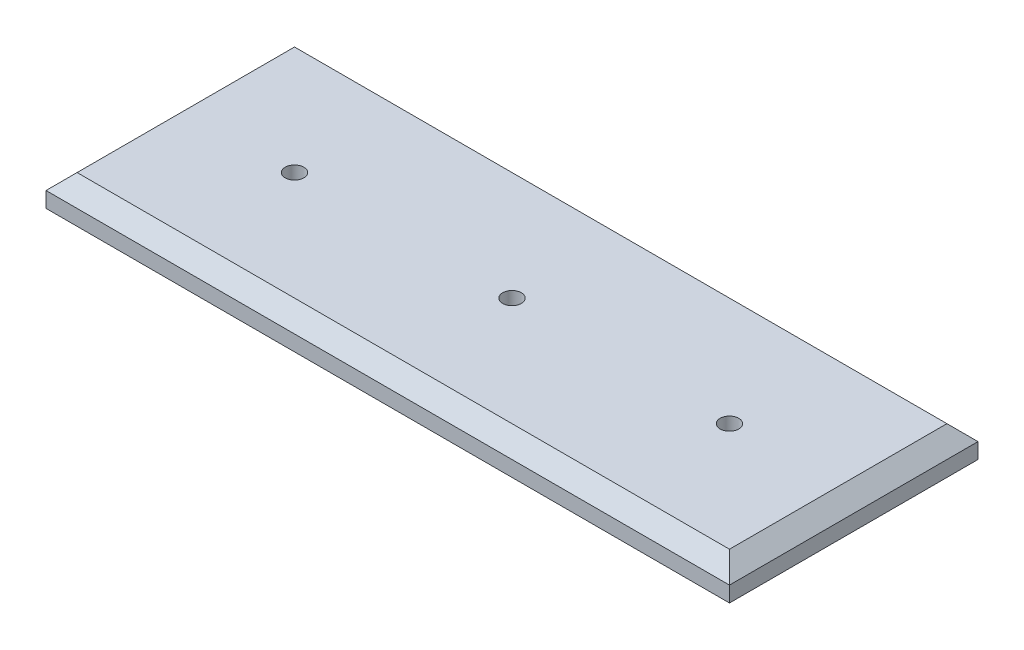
from build123d import *

# Parameters (mm, degrees)
SKETCH1_W      = 220
SKETCH1_H      = 80
EXTRUDE1_DEPTH = 10
SKETCH2_W      = 210
SKETCH2_H      = 70
EXTRUDE2_DEPTH = 5
SKETCH3_R      = 3
EXTRUDE3_DEPTH = 5
CHAMFER1_SIZE  = 5


with BuildPart() as part:
    # Sketch1 → Extrude1 (new body)
    with BuildSketch(Plane(origin=(0, 0, 0), x_dir=(1, 0, 0), z_dir=(0, 1, 0))):
        with Locations((110, 40)):
            Rectangle(SKETCH1_W, SKETCH1_H)
    extrude(amount=EXTRUDE1_DEPTH)

    # Sketch2 → Extrude2 (cut)
    with BuildSketch(Plane.XZ):
        with Locations((110, -40)):
            Rectangle(SKETCH2_W, SKETCH2_H)
    extrude(amount=-EXTRUDE2_DEPTH, mode=Mode.SUBTRACT)

    # Sketch3 → Extrude3 (cut)
    with BuildSketch(Plane(origin=(0, 10, 0), x_dir=(1, 0, 0), z_dir=(0, 1, 0))):
        with Locations(Location((110, 40, 0), (0, 0, 270))):
            Circle(SKETCH3_R)
        with Locations(Location((40, 40, 0), (0, 0, 270))):
            Circle(SKETCH3_R)
        with Locations(Location((180, 40, 0), (0, 0, 270))):
            Circle(SKETCH3_R)
    extrude(amount=-EXTRUDE3_DEPTH, mode=Mode.SUBTRACT)

    # Chamfer1
    chamfer1_edges = [part.edges().sort_by_distance(p)[0] for p in [
        (220, 10, -40),
        (110, 10, -80),
        (0, 10, -40),
        (110, 10, 0),
    ]]
    chamfer(chamfer1_edges, length=CHAMFER1_SIZE)


solid = part.part
